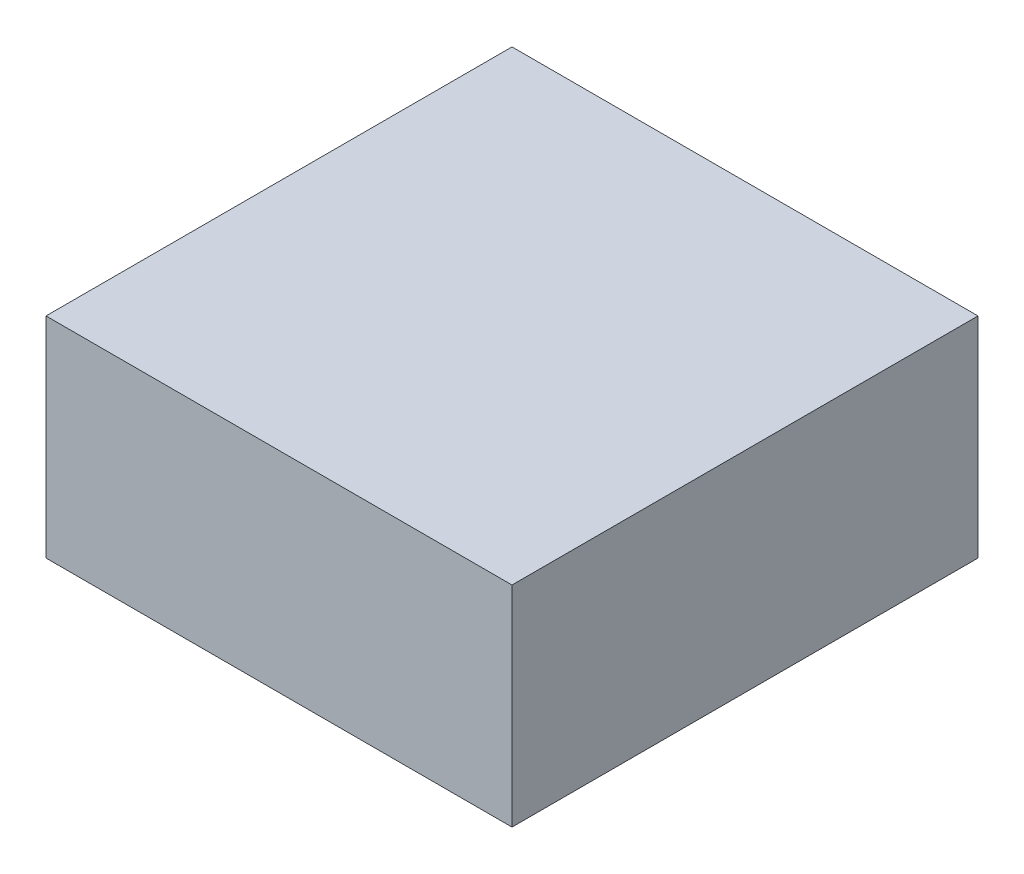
ISO-10303-21;
HEADER;
FILE_DESCRIPTION(('STEP AP214'),'2;1');
FILE_NAME('part.step','',(''),(''),'','','');
FILE_SCHEMA(('AUTOMOTIVE_DESIGN { 1 0 10303 214 1 1 1 1 }'));
ENDSEC;
DATA;
#1=APPLICATION_CONTEXT('core data for automotive mechanical design processes');
#2=APPLICATION_PROTOCOL_DEFINITION('international standard','automotive_design',2000,#1);
#3=PRODUCT_CONTEXT('',#1,'mechanical');
#4=PRODUCT('Part','Part','',(#3));
#5=PRODUCT_RELATED_PRODUCT_CATEGORY('part','',(#4));
#6=PRODUCT_DEFINITION_FORMATION('','',#4);
#7=PRODUCT_DEFINITION_CONTEXT('part definition',#1,'design');
#8=PRODUCT_DEFINITION('design','',#6,#7);
#9=PRODUCT_DEFINITION_SHAPE('','',#8);
#10=(LENGTH_UNIT() NAMED_UNIT(*) SI_UNIT(.MILLI.,.METRE.));
#11=(NAMED_UNIT(*) PLANE_ANGLE_UNIT() SI_UNIT($,.RADIAN.));
#12=(NAMED_UNIT(*) SI_UNIT($,.STERADIAN.) SOLID_ANGLE_UNIT());
#13=UNCERTAINTY_MEASURE_WITH_UNIT(LENGTH_MEASURE(1.E-05),#10,'distance_accuracy_value','');
#14=(GEOMETRIC_REPRESENTATION_CONTEXT(3) GLOBAL_UNCERTAINTY_ASSIGNED_CONTEXT((#13)) GLOBAL_UNIT_ASSIGNED_CONTEXT((#10,
#11,#12)) REPRESENTATION_CONTEXT('',''));
#15=CARTESIAN_POINT('',(0.,0.,0.));
#16=DIRECTION('',(0.,0.,1.));
#17=DIRECTION('',(1.,0.,0.));
#18=AXIS2_PLACEMENT_3D('',#15,#16,#17);
#19=CARTESIAN_POINT('',(-50.,25.,100.));
#20=DIRECTION('',(1.,0.,0.));
#21=DIRECTION('',(0.,0.,-1.));
#22=AXIS2_PLACEMENT_3D('',#19,#20,#21);
#23=PLANE('',#22);
#24=DIRECTION('',(0.,-1.,0.));
#25=VECTOR('',#24,1.);
#26=CARTESIAN_POINT('',(-50.,25.,0.));
#27=LINE('',#26,#25);
#28=CARTESIAN_POINT('',(-50.,25.,0.));
#29=VERTEX_POINT('',#28);
#30=CARTESIAN_POINT('',(-50.,-20.,0.));
#31=VERTEX_POINT('',#30);
#32=EDGE_CURVE('E77',#29,#31,#27,.T.);
#33=ORIENTED_EDGE('',*,*,#32,.T.);
#34=DIRECTION('',(0.,0.,-1.));
#35=VECTOR('',#34,1.);
#36=CARTESIAN_POINT('',(-50.,-20.,100.));
#37=LINE('',#36,#35);
#38=CARTESIAN_POINT('',(-50.,-20.,100.));
#39=VERTEX_POINT('',#38);
#40=EDGE_CURVE('E11',#39,#31,#37,.T.);
#41=ORIENTED_EDGE('',*,*,#40,.F.);
#42=DIRECTION('',(0.,-1.,0.));
#43=VECTOR('',#42,1.);
#44=CARTESIAN_POINT('',(-50.,25.,100.));
#45=LINE('',#44,#43);
#46=CARTESIAN_POINT('',(-50.,25.,100.));
#47=VERTEX_POINT('',#46);
#48=EDGE_CURVE('E100',#47,#39,#45,.T.);
#49=ORIENTED_EDGE('',*,*,#48,.F.);
#50=DIRECTION('',(0.,0.,-1.));
#51=VECTOR('',#50,1.);
#52=CARTESIAN_POINT('',(-50.,25.,100.));
#53=LINE('',#52,#51);
#54=EDGE_CURVE('E89',#47,#29,#53,.T.);
#55=ORIENTED_EDGE('',*,*,#54,.T.);
#56=EDGE_LOOP('',(#33,#41,#49,#55));
#57=FACE_BOUND('',#56,.T.);
#58=ADVANCED_FACE('F33',(#57),#23,.F.);
#59=CARTESIAN_POINT('',(-50.,-20.,100.));
#60=DIRECTION('',(0.,1.,0.));
#61=DIRECTION('',(-1.,0.,0.));
#62=AXIS2_PLACEMENT_3D('',#59,#60,#61);
#63=PLANE('',#62);
#64=CARTESIAN_POINT('',(0.,-20.,50.));
#65=DIRECTION('',(0.,-1.,0.));
#66=DIRECTION('',(0.,0.,-1.));
#67=AXIS2_PLACEMENT_3D('',#64,#65,#66);
#68=CIRCLE('',#67,22.);
#69=CARTESIAN_POINT('',(0.,-20.,28.));
#70=VERTEX_POINT('',#69);
#71=EDGE_CURVE('E93',#70,#70,#68,.T.);
#72=ORIENTED_EDGE('',*,*,#71,.F.);
#73=EDGE_LOOP('',(#72));
#74=FACE_BOUND('',#73,.T.);
#75=DIRECTION('',(1.,0.,0.));
#76=VECTOR('',#75,1.);
#77=CARTESIAN_POINT('',(-50.,-20.,0.));
#78=LINE('',#77,#76);
#79=CARTESIAN_POINT('',(50.,-20.,0.));
#80=VERTEX_POINT('',#79);
#81=EDGE_CURVE('E73',#31,#80,#78,.T.);
#82=ORIENTED_EDGE('',*,*,#81,.T.);
#83=DIRECTION('',(0.,0.,-1.));
#84=VECTOR('',#83,1.);
#85=CARTESIAN_POINT('',(50.,-20.,100.));
#86=LINE('',#85,#84);
#87=CARTESIAN_POINT('',(50.,-20.,100.));
#88=VERTEX_POINT('',#87);
#89=EDGE_CURVE('E40',#88,#80,#86,.T.);
#90=ORIENTED_EDGE('',*,*,#89,.F.);
#91=DIRECTION('',(1.,0.,0.));
#92=VECTOR('',#91,1.);
#93=CARTESIAN_POINT('',(-50.,-20.,100.));
#94=LINE('',#93,#92);
#95=EDGE_CURVE('E85',#39,#88,#94,.T.);
#96=ORIENTED_EDGE('',*,*,#95,.F.);
#97=ORIENTED_EDGE('',*,*,#40,.T.);
#98=EDGE_LOOP('',(#82,#90,#96,#97));
#99=FACE_BOUND('',#98,.T.);
#100=ADVANCED_FACE('F84',(#74,#99),#63,.F.);
#101=CARTESIAN_POINT('',(50.,25.,100.));
#102=DIRECTION('',(-1.,0.,0.));
#103=DIRECTION('',(0.,-1.,0.));
#104=AXIS2_PLACEMENT_3D('',#101,#102,#103);
#105=PLANE('',#104);
#106=DIRECTION('',(0.,1.,0.));
#107=VECTOR('',#106,1.);
#108=CARTESIAN_POINT('',(50.,25.,0.));
#109=LINE('',#108,#107);
#110=CARTESIAN_POINT('',(50.,25.,0.));
#111=VERTEX_POINT('',#110);
#112=EDGE_CURVE('E78',#80,#111,#109,.T.);
#113=ORIENTED_EDGE('',*,*,#112,.T.);
#114=DIRECTION('',(0.,0.,-1.));
#115=VECTOR('',#114,1.);
#116=CARTESIAN_POINT('',(50.,25.,100.));
#117=LINE('',#116,#115);
#118=CARTESIAN_POINT('',(50.,25.,100.));
#119=VERTEX_POINT('',#118);
#120=EDGE_CURVE('E106',#119,#111,#117,.T.);
#121=ORIENTED_EDGE('',*,*,#120,.F.);
#122=DIRECTION('',(0.,1.,0.));
#123=VECTOR('',#122,1.);
#124=CARTESIAN_POINT('',(50.,25.,100.));
#125=LINE('',#124,#123);
#126=EDGE_CURVE('E52',#88,#119,#125,.T.);
#127=ORIENTED_EDGE('',*,*,#126,.F.);
#128=ORIENTED_EDGE('',*,*,#89,.T.);
#129=EDGE_LOOP('',(#113,#121,#127,#128));
#130=FACE_BOUND('',#129,.T.);
#131=ADVANCED_FACE('F109',(#130),#105,.F.);
#132=CARTESIAN_POINT('',(-50.,25.,100.));
#133=DIRECTION('',(0.,-1.,0.));
#134=DIRECTION('',(0.,0.,-1.));
#135=AXIS2_PLACEMENT_3D('',#132,#133,#134);
#136=PLANE('',#135);
#137=DIRECTION('',(-1.,0.,0.));
#138=VECTOR('',#137,1.);
#139=CARTESIAN_POINT('',(-50.,25.,0.));
#140=LINE('',#139,#138);
#141=EDGE_CURVE('E98',#111,#29,#140,.T.);
#142=ORIENTED_EDGE('',*,*,#141,.T.);
#143=ORIENTED_EDGE('',*,*,#54,.F.);
#144=DIRECTION('',(-1.,0.,0.));
#145=VECTOR('',#144,1.);
#146=CARTESIAN_POINT('',(-50.,25.,100.));
#147=LINE('',#146,#145);
#148=EDGE_CURVE('E47',#119,#47,#147,.T.);
#149=ORIENTED_EDGE('',*,*,#148,.F.);
#150=ORIENTED_EDGE('',*,*,#120,.T.);
#151=EDGE_LOOP('',(#142,#143,#149,#150));
#152=FACE_BOUND('',#151,.T.);
#153=ADVANCED_FACE('F111',(#152),#136,.F.);
#154=CARTESIAN_POINT('',(-50.,25.,100.));
#155=DIRECTION('',(0.,0.,1.));
#156=DIRECTION('',(1.,0.,0.));
#157=AXIS2_PLACEMENT_3D('',#154,#155,#156);
#158=PLANE('',#157);
#159=ORIENTED_EDGE('',*,*,#48,.T.);
#160=ORIENTED_EDGE('',*,*,#95,.T.);
#161=ORIENTED_EDGE('',*,*,#126,.T.);
#162=ORIENTED_EDGE('',*,*,#148,.T.);
#163=EDGE_LOOP('',(#159,#160,#161,#162));
#164=FACE_BOUND('',#163,.T.);
#165=ADVANCED_FACE('F112',(#164),#158,.T.);
#166=CARTESIAN_POINT('',(-50.,25.,0.));
#167=DIRECTION('',(0.,0.,1.));
#168=DIRECTION('',(1.,0.,0.));
#169=AXIS2_PLACEMENT_3D('',#166,#167,#168);
#170=PLANE('',#169);
#171=ORIENTED_EDGE('',*,*,#32,.F.);
#172=ORIENTED_EDGE('',*,*,#141,.F.);
#173=ORIENTED_EDGE('',*,*,#112,.F.);
#174=ORIENTED_EDGE('',*,*,#81,.F.);
#175=EDGE_LOOP('',(#171,#172,#173,#174));
#176=FACE_BOUND('',#175,.T.);
#177=ADVANCED_FACE('F74',(#176),#170,.F.);
#178=CARTESIAN_POINT('',(0.,-20.,50.));
#179=DIRECTION('',(0.,-1.,0.));
#180=DIRECTION('',(0.,0.,-1.));
#181=AXIS2_PLACEMENT_3D('',#178,#179,#180);
#182=CONICAL_SURFACE('',#181,22.,0.20943951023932);
#183=CARTESIAN_POINT('',(0.,-3.,50.));
#184=DIRECTION('',(0.,-1.,0.));
#185=DIRECTION('',(0.,0.,-1.));
#186=AXIS2_PLACEMENT_3D('',#183,#184,#185);
#187=CIRCLE('',#186,18.3865384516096);
#188=CARTESIAN_POINT('',(0.,-3.,31.6134615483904));
#189=VERTEX_POINT('',#188);
#190=EDGE_CURVE('E90',#189,#189,#187,.T.);
#191=ORIENTED_EDGE('',*,*,#190,.F.);
#192=EDGE_LOOP('',(#191));
#193=FACE_BOUND('',#192,.T.);
#194=ORIENTED_EDGE('',*,*,#71,.T.);
#195=EDGE_LOOP('',(#194));
#196=FACE_BOUND('',#195,.T.);
#197=ADVANCED_FACE('F119',(#193,#196),#182,.F.);
#198=CARTESIAN_POINT('',(0.,-3.,50.));
#199=DIRECTION('',(0.,-1.,0.));
#200=DIRECTION('',(0.,0.,-1.));
#201=AXIS2_PLACEMENT_3D('',#198,#199,#200);
#202=PLANE('',#201);
#203=ORIENTED_EDGE('',*,*,#190,.T.);
#204=EDGE_LOOP('',(#203));
#205=FACE_BOUND('',#204,.T.);
#206=ADVANCED_FACE('F135',(#205),#202,.T.);
#207=CLOSED_SHELL('',(#58,#100,#131,#153,#165,#177,#197,#206));
#208=MANIFOLD_SOLID_BREP('B2',#207);
#209=ADVANCED_BREP_SHAPE_REPRESENTATION('',(#18,#208),#14);
#210=SHAPE_DEFINITION_REPRESENTATION(#9,#209);
ENDSEC;
END-ISO-10303-21;
